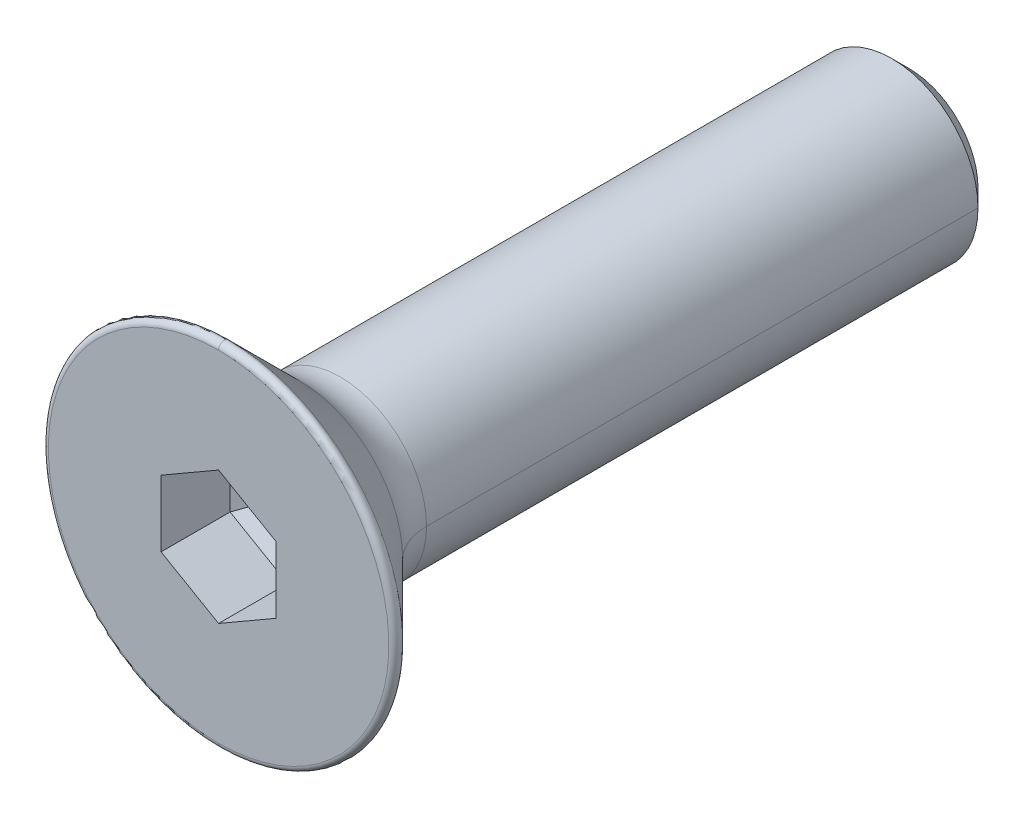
ISO-10303-21;
HEADER;
FILE_DESCRIPTION(('STEP AP214'),'2;1');
FILE_NAME('part.step','',(''),(''),'','','');
FILE_SCHEMA(('AUTOMOTIVE_DESIGN { 1 0 10303 214 1 1 1 1 }'));
ENDSEC;
DATA;
#1=APPLICATION_CONTEXT('core data for automotive mechanical design processes');
#2=APPLICATION_PROTOCOL_DEFINITION('international standard','automotive_design',2000,#1);
#3=PRODUCT_CONTEXT('',#1,'mechanical');
#4=PRODUCT('Part','Part','',(#3));
#5=PRODUCT_RELATED_PRODUCT_CATEGORY('part','',(#4));
#6=PRODUCT_DEFINITION_FORMATION('','',#4);
#7=PRODUCT_DEFINITION_CONTEXT('part definition',#1,'design');
#8=PRODUCT_DEFINITION('design','',#6,#7);
#9=PRODUCT_DEFINITION_SHAPE('','',#8);
#10=(LENGTH_UNIT() NAMED_UNIT(*) SI_UNIT(.MILLI.,.METRE.));
#11=(NAMED_UNIT(*) PLANE_ANGLE_UNIT() SI_UNIT($,.RADIAN.));
#12=(NAMED_UNIT(*) SI_UNIT($,.STERADIAN.) SOLID_ANGLE_UNIT());
#13=UNCERTAINTY_MEASURE_WITH_UNIT(LENGTH_MEASURE(1.E-05),#10,'distance_accuracy_value','');
#14=(GEOMETRIC_REPRESENTATION_CONTEXT(3) GLOBAL_UNCERTAINTY_ASSIGNED_CONTEXT((#13)) GLOBAL_UNIT_ASSIGNED_CONTEXT((#10,
#11,#12)) REPRESENTATION_CONTEXT('',''));
#15=CARTESIAN_POINT('',(0.,0.,0.));
#16=DIRECTION('',(0.,0.,1.));
#17=DIRECTION('',(1.,0.,0.));
#18=AXIS2_PLACEMENT_3D('',#15,#16,#17);
#19=CARTESIAN_POINT('',(0.,0.,0.));
#20=DIRECTION('',(0.,0.,1.));
#21=DIRECTION('',(1.,0.,0.));
#22=AXIS2_PLACEMENT_3D('',#19,#20,#21);
#23=CYLINDRICAL_SURFACE('',#22,1.5);
#24=DIRECTION('',(1.125877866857E-08,-1.397566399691E-11,1.));
#25=VECTOR('',#24,1.);
#26=CARTESIAN_POINT('',(1.499999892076,1.300586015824E-10,0.3000001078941));
#27=LINE('',#26,#25);
#28=CARTESIAN_POINT('',(1.5,0.,0.3000003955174));
#29=VERTEX_POINT('',#28);
#30=CARTESIAN_POINT('',(1.5,0.,9.885786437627));
#31=VERTEX_POINT('',#30);
#32=EDGE_CURVE('E170',#29,#31,#27,.T.);
#33=ORIENTED_EDGE('',*,*,#32,.F.);
#34=CARTESIAN_POINT('',(0.,0.,0.3000003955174));
#35=DIRECTION('',(0.,0.,-1.));
#36=DIRECTION('',(-1.,0.,0.));
#37=AXIS2_PLACEMENT_3D('',#34,#35,#36);
#38=CIRCLE('',#37,1.5);
#39=CARTESIAN_POINT('',(-1.5,0.,0.3000003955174));
#40=VERTEX_POINT('',#39);
#41=EDGE_CURVE('E265',#40,#29,#38,.T.);
#42=ORIENTED_EDGE('',*,*,#41,.F.);
#43=DIRECTION('',(-1.125877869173E-08,1.383975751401E-11,1.));
#44=VECTOR('',#43,1.);
#45=CARTESIAN_POINT('',(-1.499999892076,-1.300583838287E-10,0.3000001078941));
#46=LINE('',#45,#44);
#47=CARTESIAN_POINT('',(-1.5,0.,9.885786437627));
#48=VERTEX_POINT('',#47);
#49=EDGE_CURVE('E163',#40,#48,#46,.T.);
#50=ORIENTED_EDGE('',*,*,#49,.T.);
#51=CARTESIAN_POINT('',(0.,0.,9.885786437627));
#52=DIRECTION('',(0.,0.,-1.));
#53=DIRECTION('',(-1.,0.,0.));
#54=AXIS2_PLACEMENT_3D('',#51,#52,#53);
#55=CIRCLE('',#54,1.5);
#56=EDGE_CURVE('E197',#48,#31,#55,.T.);
#57=ORIENTED_EDGE('',*,*,#56,.T.);
#58=EDGE_LOOP('',(#33,#42,#50,#57));
#59=FACE_BOUND('',#58,.T.);
#60=ADVANCED_FACE('F16',(#59),#23,.T.);
#61=CARTESIAN_POINT('',(0.,0.,9.885786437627));
#62=DIRECTION('',(0.,0.,1.));
#63=DIRECTION('',(-0.0139722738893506,-0.999902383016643,0.));
#64=AXIS2_PLACEMENT_3D('',#61,#62,#63);
#65=TOROIDAL_SURFACE('',#64,2.5,1.);
#66=CARTESIAN_POINT('',(2.5,-2.01547827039E-10,9.885786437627));
#67=DIRECTION('',(8.061912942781E-11,1.,0.));
#68=DIRECTION('',(-1.,8.061912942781E-11,0.));
#69=AXIS2_PLACEMENT_3D('',#66,#67,#68);
#70=CIRCLE('',#69,1.);
#71=CARTESIAN_POINT('',(1.792893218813,0.,10.59289321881));
#72=VERTEX_POINT('',#71);
#73=EDGE_CURVE('E20',#31,#72,#70,.T.);
#74=ORIENTED_EDGE('',*,*,#73,.T.);
#75=CARTESIAN_POINT('',(0.,0.,10.59289321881));
#76=DIRECTION('',(0.,0.,1.));
#77=DIRECTION('',(0.,-1.,0.));
#78=AXIS2_PLACEMENT_3D('',#75,#76,#77);
#79=CIRCLE('',#78,1.792893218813);
#80=CARTESIAN_POINT('',(0.,-1.792893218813,10.59289321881));
#81=VERTEX_POINT('',#80);
#82=EDGE_CURVE('E10',#81,#72,#79,.T.);
#83=ORIENTED_EDGE('',*,*,#82,.F.);
#84=CARTESIAN_POINT('',(-1.556611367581E-10,-2.5,9.885786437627));
#85=DIRECTION('',(1.,-6.226445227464E-11,0.));
#86=DIRECTION('',(6.226445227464E-11,1.,0.));
#87=AXIS2_PLACEMENT_3D('',#84,#85,#86);
#88=CIRCLE('',#87,1.);
#89=CARTESIAN_POINT('',(0.,-1.5,9.885786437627));
#90=VERTEX_POINT('',#89);
#91=EDGE_CURVE('E278',#90,#81,#88,.T.);
#92=ORIENTED_EDGE('',*,*,#91,.F.);
#93=CARTESIAN_POINT('',(0.,0.,9.885786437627));
#94=DIRECTION('',(0.,0.,1.));
#95=DIRECTION('',(0.,-1.,0.));
#96=AXIS2_PLACEMENT_3D('',#93,#94,#95);
#97=CIRCLE('',#96,1.5);
#98=EDGE_CURVE('E194',#90,#31,#97,.T.);
#99=ORIENTED_EDGE('',*,*,#98,.T.);
#100=EDGE_LOOP('',(#74,#83,#92,#99));
#101=FACE_BOUND('',#100,.T.);
#102=ADVANCED_FACE('F192',(#101),#65,.F.);
#103=CARTESIAN_POINT('',(0.,0.,11.21109127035));
#104=DIRECTION('',(0.,0.,1.));
#105=DIRECTION('',(0.,1.,0.));
#106=AXIS2_PLACEMENT_3D('',#103,#104,#105);
#107=CONICAL_SURFACE('',#106,2.411091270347,0.7853981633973);
#108=DIRECTION('',(-1.68789271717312E-12,-0.707106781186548,0.707106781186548));
#109=VECTOR('',#108,1.);
#110=CARTESIAN_POINT('',(-9.017178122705E-13,-1.792893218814,10.59289321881));
#111=LINE('',#110,#109);
#112=CARTESIAN_POINT('',(0.,-3.029289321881,11.82928932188));
#113=VERTEX_POINT('',#112);
#114=EDGE_CURVE('E187',#81,#113,#111,.T.);
#115=ORIENTED_EDGE('',*,*,#114,.F.);
#116=ORIENTED_EDGE('',*,*,#82,.T.);
#117=CARTESIAN_POINT('',(0.,0.,10.59289321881));
#118=DIRECTION('',(0.,0.,1.));
#119=DIRECTION('',(1.,0.,0.));
#120=AXIS2_PLACEMENT_3D('',#117,#118,#119);
#121=CIRCLE('',#120,1.792893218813);
#122=CARTESIAN_POINT('',(0.,1.792893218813,10.59289321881));
#123=VERTEX_POINT('',#122);
#124=EDGE_CURVE('E185',#72,#123,#121,.T.);
#125=ORIENTED_EDGE('',*,*,#124,.T.);
#126=DIRECTION('',(1.85910408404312E-12,0.707106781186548,0.707106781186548));
#127=VECTOR('',#126,1.);
#128=CARTESIAN_POINT('',(6.008498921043E-13,1.792893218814,10.59289321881));
#129=LINE('',#128,#127);
#130=CARTESIAN_POINT('',(0.,3.029289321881,11.82928932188));
#131=VERTEX_POINT('',#130);
#132=EDGE_CURVE('E249',#123,#131,#129,.T.);
#133=ORIENTED_EDGE('',*,*,#132,.T.);
#134=CARTESIAN_POINT('',(0.,0.,11.82928932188));
#135=DIRECTION('',(0.,0.,1.));
#136=DIRECTION('',(0.,-1.,0.));
#137=AXIS2_PLACEMENT_3D('',#134,#135,#136);
#138=CIRCLE('',#137,3.029289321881);
#139=EDGE_CURVE('E27',#113,#131,#138,.T.);
#140=ORIENTED_EDGE('',*,*,#139,.F.);
#141=EDGE_LOOP('',(#115,#116,#125,#133,#140));
#142=FACE_BOUND('',#141,.T.);
#143=ADVANCED_FACE('F182',(#142),#107,.T.);
#144=CARTESIAN_POINT('',(0.,0.,11.9));
#145=DIRECTION('',(0.,0.,-1.));
#146=DIRECTION('',(-0.0131526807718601,-0.999913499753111,0.));
#147=AXIS2_PLACEMENT_3D('',#144,#145,#146);
#148=TOROIDAL_SURFACE('',#147,2.958578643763,0.1);
#149=CARTESIAN_POINT('',(0.,-2.958578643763,11.9));
#150=DIRECTION('',(1.,0.,0.));
#151=DIRECTION('',(0.,0.,1.));
#152=AXIS2_PLACEMENT_3D('',#149,#150,#151);
#153=CIRCLE('',#152,0.1);
#154=CARTESIAN_POINT('',(0.,-2.958578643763,12.));
#155=VERTEX_POINT('',#154);
#156=EDGE_CURVE('E337',#155,#113,#153,.T.);
#157=ORIENTED_EDGE('',*,*,#156,.T.);
#158=ORIENTED_EDGE('',*,*,#139,.T.);
#159=CARTESIAN_POINT('',(0.,2.958578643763,11.9));
#160=DIRECTION('',(-1.,0.,0.));
#161=DIRECTION('',(0.,0.,1.));
#162=AXIS2_PLACEMENT_3D('',#159,#160,#161);
#163=CIRCLE('',#162,0.1);
#164=CARTESIAN_POINT('',(0.,2.958578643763,12.));
#165=VERTEX_POINT('',#164);
#166=EDGE_CURVE('E291',#165,#131,#163,.T.);
#167=ORIENTED_EDGE('',*,*,#166,.F.);
#168=CARTESIAN_POINT('',(0.,0.,12.));
#169=DIRECTION('',(0.,0.,1.));
#170=DIRECTION('',(0.,-1.,0.));
#171=AXIS2_PLACEMENT_3D('',#168,#169,#170);
#172=CIRCLE('',#171,2.958578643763);
#173=EDGE_CURVE('E227',#155,#165,#172,.T.);
#174=ORIENTED_EDGE('',*,*,#173,.F.);
#175=EDGE_LOOP('',(#157,#158,#167,#174));
#176=FACE_BOUND('',#175,.T.);
#177=ADVANCED_FACE('F449',(#176),#148,.T.);
#178=CARTESIAN_POINT('',(0.,0.,10.2));
#179=DIRECTION('',(0.,0.,1.));
#180=DIRECTION('',(1.,0.,0.));
#181=AXIS2_PLACEMENT_3D('',#178,#179,#180);
#182=PLANE('',#181);
#183=DIRECTION('',(0.,1.,0.));
#184=VECTOR('',#183,1.);
#185=CARTESIAN_POINT('',(0.04330127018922,-0.025,10.2));
#186=LINE('',#185,#184);
#187=CARTESIAN_POINT('',(0.04330127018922,-0.025,10.2));
#188=VERTEX_POINT('',#187);
#189=CARTESIAN_POINT('',(0.04330127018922,0.025,10.2));
#190=VERTEX_POINT('',#189);
#191=EDGE_CURVE('E41',#188,#190,#186,.T.);
#192=ORIENTED_EDGE('',*,*,#191,.T.);
#193=DIRECTION('',(-0.866025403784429,0.500000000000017,0.));
#194=VECTOR('',#193,1.);
#195=CARTESIAN_POINT('',(0.04330127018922,0.025,10.2));
#196=LINE('',#195,#194);
#197=CARTESIAN_POINT('',(0.,0.05,10.2));
#198=VERTEX_POINT('',#197);
#199=EDGE_CURVE('E281',#190,#198,#196,.T.);
#200=ORIENTED_EDGE('',*,*,#199,.T.);
#201=DIRECTION('',(-0.866025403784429,-0.500000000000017,0.));
#202=VECTOR('',#201,1.);
#203=CARTESIAN_POINT('',(0.,0.05,10.2));
#204=LINE('',#203,#202);
#205=CARTESIAN_POINT('',(-0.04330127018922,0.025,10.2));
#206=VERTEX_POINT('',#205);
#207=EDGE_CURVE('E294',#198,#206,#204,.T.);
#208=ORIENTED_EDGE('',*,*,#207,.T.);
#209=DIRECTION('',(0.,-1.,0.));
#210=VECTOR('',#209,1.);
#211=CARTESIAN_POINT('',(-0.04330127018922,0.025,10.2));
#212=LINE('',#211,#210);
#213=CARTESIAN_POINT('',(-0.04330127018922,-0.025,10.2));
#214=VERTEX_POINT('',#213);
#215=EDGE_CURVE('E270',#206,#214,#212,.T.);
#216=ORIENTED_EDGE('',*,*,#215,.T.);
#217=DIRECTION('',(0.866025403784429,-0.500000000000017,0.));
#218=VECTOR('',#217,1.);
#219=CARTESIAN_POINT('',(-0.04330127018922,-0.025,10.2));
#220=LINE('',#219,#218);
#221=CARTESIAN_POINT('',(0.,-0.05,10.2));
#222=VERTEX_POINT('',#221);
#223=EDGE_CURVE('E219',#214,#222,#220,.T.);
#224=ORIENTED_EDGE('',*,*,#223,.T.);
#225=DIRECTION('',(0.866025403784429,0.500000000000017,0.));
#226=VECTOR('',#225,1.);
#227=CARTESIAN_POINT('',(0.,-0.05,10.2));
#228=LINE('',#227,#226);
#229=EDGE_CURVE('E309',#222,#188,#228,.T.);
#230=ORIENTED_EDGE('',*,*,#229,.T.);
#231=EDGE_LOOP('',(#192,#200,#208,#216,#224,#230));
#232=FACE_BOUND('',#231,.T.);
#233=ADVANCED_FACE('F406',(#232),#182,.T.);
#234=CARTESIAN_POINT('',(1.,-0.5773502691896,12.));
#235=DIRECTION('',(1.,0.,0.));
#236=DIRECTION('',(0.,1.,0.));
#237=AXIS2_PLACEMENT_3D('',#234,#235,#236);
#238=PLANE('',#237);
#239=DIRECTION('',(0.,0.,-1.));
#240=VECTOR('',#239,1.);
#241=CARTESIAN_POINT('',(1.,-0.5773502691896,12.));
#242=LINE('',#241,#240);
#243=CARTESIAN_POINT('',(1.,-0.5773502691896,12.));
#244=VERTEX_POINT('',#243);
#245=CARTESIAN_POINT('',(1.,-0.5773502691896,10.8));
#246=VERTEX_POINT('',#245);
#247=EDGE_CURVE('E239',#244,#246,#242,.T.);
#248=ORIENTED_EDGE('',*,*,#247,.F.);
#249=DIRECTION('',(0.,1.,0.));
#250=VECTOR('',#249,1.);
#251=CARTESIAN_POINT('',(1.,-0.5773502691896,12.));
#252=LINE('',#251,#250);
#253=CARTESIAN_POINT('',(1.,0.5773502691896,12.));
#254=VERTEX_POINT('',#253);
#255=EDGE_CURVE('E331',#244,#254,#252,.T.);
#256=ORIENTED_EDGE('',*,*,#255,.T.);
#257=DIRECTION('',(0.,0.,-1.));
#258=VECTOR('',#257,1.);
#259=CARTESIAN_POINT('',(1.,0.5773502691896,12.));
#260=LINE('',#259,#258);
#261=CARTESIAN_POINT('',(1.,0.5773502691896,10.8));
#262=VERTEX_POINT('',#261);
#263=EDGE_CURVE('E240',#254,#262,#260,.T.);
#264=ORIENTED_EDGE('',*,*,#263,.T.);
#265=DIRECTION('',(0.,1.,0.));
#266=VECTOR('',#265,1.);
#267=CARTESIAN_POINT('',(1.,-0.5773502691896,10.8));
#268=LINE('',#267,#266);
#269=EDGE_CURVE('E225',#246,#262,#268,.T.);
#270=ORIENTED_EDGE('',*,*,#269,.F.);
#271=EDGE_LOOP('',(#248,#256,#264,#270));
#272=FACE_BOUND('',#271,.T.);
#273=ADVANCED_FACE('F402',(#272),#238,.F.);
#274=CARTESIAN_POINT('',(0.5216506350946,0.,10.5));
#275=DIRECTION('',(0.531312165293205,0.,-0.847176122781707));
#276=DIRECTION('',(0.,-1.,0.));
#277=AXIS2_PLACEMENT_3D('',#274,#275,#276);
#278=PLANE('',#277);
#279=DIRECTION('',(0.761021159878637,0.439375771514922,0.477279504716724));
#280=VECTOR('',#279,1.);
#281=CARTESIAN_POINT('',(0.04330127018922,0.025,10.2));
#282=LINE('',#281,#280);
#283=EDGE_CURVE('E226',#190,#262,#282,.T.);
#284=ORIENTED_EDGE('',*,*,#283,.F.);
#285=ORIENTED_EDGE('',*,*,#191,.F.);
#286=DIRECTION('',(0.761021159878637,-0.439375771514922,0.477279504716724));
#287=VECTOR('',#286,1.);
#288=CARTESIAN_POINT('',(0.04330127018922,-0.025,10.2));
#289=LINE('',#288,#287);
#290=EDGE_CURVE('E238',#188,#246,#289,.T.);
#291=ORIENTED_EDGE('',*,*,#290,.T.);
#292=ORIENTED_EDGE('',*,*,#269,.T.);
#293=EDGE_LOOP('',(#284,#285,#291,#292));
#294=FACE_BOUND('',#293,.T.);
#295=ADVANCED_FACE('F404',(#294),#278,.F.);
#296=CARTESIAN_POINT('',(0.2608253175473,0.4517627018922,10.5));
#297=DIRECTION('',(0.265656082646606,0.46012983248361,-0.847176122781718));
#298=DIRECTION('',(-0.954186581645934,0.,-0.299212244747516));
#299=AXIS2_PLACEMENT_3D('',#296,#297,#298);
#300=PLANE('',#299);
#301=DIRECTION('',(0.,0.878751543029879,0.477279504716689));
#302=VECTOR('',#301,1.);
#303=CARTESIAN_POINT('',(0.,0.05,10.2));
#304=LINE('',#303,#302);
#305=CARTESIAN_POINT('',(0.,1.154700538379,10.8));
#306=VERTEX_POINT('',#305);
#307=EDGE_CURVE('E287',#198,#306,#304,.T.);
#308=ORIENTED_EDGE('',*,*,#307,.F.);
#309=ORIENTED_EDGE('',*,*,#199,.F.);
#310=ORIENTED_EDGE('',*,*,#283,.T.);
#311=DIRECTION('',(-0.866025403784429,0.500000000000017,0.));
#312=VECTOR('',#311,1.);
#313=CARTESIAN_POINT('',(1.,0.5773502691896,10.8));
#314=LINE('',#313,#312);
#315=EDGE_CURVE('E244',#262,#306,#314,.T.);
#316=ORIENTED_EDGE('',*,*,#315,.T.);
#317=EDGE_LOOP('',(#308,#309,#310,#316));
#318=FACE_BOUND('',#317,.T.);
#319=ADVANCED_FACE('F459',(#318),#300,.F.);
#320=CARTESIAN_POINT('',(1.,0.5773502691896,12.));
#321=DIRECTION('',(0.500000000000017,0.866025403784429,0.));
#322=DIRECTION('',(0.,0.,-1.));
#323=AXIS2_PLACEMENT_3D('',#320,#321,#322);
#324=PLANE('',#323);
#325=ORIENTED_EDGE('',*,*,#263,.F.);
#326=DIRECTION('',(-0.866025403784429,0.500000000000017,0.));
#327=VECTOR('',#326,1.);
#328=CARTESIAN_POINT('',(1.,0.5773502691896,12.));
#329=LINE('',#328,#327);
#330=CARTESIAN_POINT('',(0.,1.154700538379,12.));
#331=VERTEX_POINT('',#330);
#332=EDGE_CURVE('E315',#254,#331,#329,.T.);
#333=ORIENTED_EDGE('',*,*,#332,.T.);
#334=DIRECTION('',(0.,0.,-1.));
#335=VECTOR('',#334,1.);
#336=CARTESIAN_POINT('',(0.,1.154700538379,12.));
#337=LINE('',#336,#335);
#338=EDGE_CURVE('E245',#331,#306,#337,.T.);
#339=ORIENTED_EDGE('',*,*,#338,.T.);
#340=ORIENTED_EDGE('',*,*,#315,.F.);
#341=EDGE_LOOP('',(#325,#333,#339,#340));
#342=FACE_BOUND('',#341,.T.);
#343=ADVANCED_FACE('F463',(#342),#324,.F.);
#344=CARTESIAN_POINT('',(0.,1.154700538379,12.));
#345=DIRECTION('',(-0.500000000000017,0.866025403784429,0.));
#346=DIRECTION('',(0.,0.,1.));
#347=AXIS2_PLACEMENT_3D('',#344,#345,#346);
#348=PLANE('',#347);
#349=ORIENTED_EDGE('',*,*,#338,.F.);
#350=DIRECTION('',(-0.866025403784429,-0.500000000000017,0.));
#351=VECTOR('',#350,1.);
#352=CARTESIAN_POINT('',(0.,1.154700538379,12.));
#353=LINE('',#352,#351);
#354=CARTESIAN_POINT('',(-1.,0.5773502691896,12.));
#355=VERTEX_POINT('',#354);
#356=EDGE_CURVE('E264',#331,#355,#353,.T.);
#357=ORIENTED_EDGE('',*,*,#356,.T.);
#358=DIRECTION('',(0.,0.,-1.));
#359=VECTOR('',#358,1.);
#360=CARTESIAN_POINT('',(-1.,0.5773502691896,12.));
#361=LINE('',#360,#359);
#362=CARTESIAN_POINT('',(-1.,0.5773502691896,10.8));
#363=VERTEX_POINT('',#362);
#364=EDGE_CURVE('E259',#355,#363,#361,.T.);
#365=ORIENTED_EDGE('',*,*,#364,.T.);
#366=DIRECTION('',(-0.866025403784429,-0.500000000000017,0.));
#367=VECTOR('',#366,1.);
#368=CARTESIAN_POINT('',(0.,1.154700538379,10.8));
#369=LINE('',#368,#367);
#370=EDGE_CURVE('E284',#306,#363,#369,.T.);
#371=ORIENTED_EDGE('',*,*,#370,.F.);
#372=EDGE_LOOP('',(#349,#357,#365,#371));
#373=FACE_BOUND('',#372,.T.);
#374=ADVANCED_FACE('F469',(#373),#348,.F.);
#375=CARTESIAN_POINT('',(-0.2608253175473,0.4517627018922,10.5));
#376=DIRECTION('',(-0.265656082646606,0.46012983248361,-0.847176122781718));
#377=DIRECTION('',(-0.954186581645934,0.,0.299212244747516));
#378=AXIS2_PLACEMENT_3D('',#375,#376,#377);
#379=PLANE('',#378);
#380=DIRECTION('',(-0.761021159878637,0.439375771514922,0.477279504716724));
#381=VECTOR('',#380,1.);
#382=CARTESIAN_POINT('',(-0.04330127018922,0.025,10.2));
#383=LINE('',#382,#381);
#384=EDGE_CURVE('E272',#206,#363,#383,.T.);
#385=ORIENTED_EDGE('',*,*,#384,.F.);
#386=ORIENTED_EDGE('',*,*,#207,.F.);
#387=ORIENTED_EDGE('',*,*,#307,.T.);
#388=ORIENTED_EDGE('',*,*,#370,.T.);
#389=EDGE_LOOP('',(#385,#386,#387,#388));
#390=FACE_BOUND('',#389,.T.);
#391=ADVANCED_FACE('F478',(#390),#379,.F.);
#392=CARTESIAN_POINT('',(-0.5216506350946,0.,10.5));
#393=DIRECTION('',(-0.531312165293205,0.,-0.847176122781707));
#394=DIRECTION('',(-0.847176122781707,0.,0.531312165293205));
#395=AXIS2_PLACEMENT_3D('',#392,#393,#394);
#396=PLANE('',#395);
#397=DIRECTION('',(-0.761021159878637,-0.439375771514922,0.477279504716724));
#398=VECTOR('',#397,1.);
#399=CARTESIAN_POINT('',(-0.04330127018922,-0.025,10.2));
#400=LINE('',#399,#398);
#401=CARTESIAN_POINT('',(-1.,-0.5773502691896,10.8));
#402=VERTEX_POINT('',#401);
#403=EDGE_CURVE('E215',#214,#402,#400,.T.);
#404=ORIENTED_EDGE('',*,*,#403,.F.);
#405=ORIENTED_EDGE('',*,*,#215,.F.);
#406=ORIENTED_EDGE('',*,*,#384,.T.);
#407=DIRECTION('',(0.,-1.,0.));
#408=VECTOR('',#407,1.);
#409=CARTESIAN_POINT('',(-1.,0.5773502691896,10.8));
#410=LINE('',#409,#408);
#411=EDGE_CURVE('E273',#363,#402,#410,.T.);
#412=ORIENTED_EDGE('',*,*,#411,.T.);
#413=EDGE_LOOP('',(#404,#405,#406,#412));
#414=FACE_BOUND('',#413,.T.);
#415=ADVANCED_FACE('F456',(#414),#396,.F.);
#416=CARTESIAN_POINT('',(-1.,0.5773502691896,12.));
#417=DIRECTION('',(-1.,0.,0.));
#418=DIRECTION('',(0.,0.,1.));
#419=AXIS2_PLACEMENT_3D('',#416,#417,#418);
#420=PLANE('',#419);
#421=ORIENTED_EDGE('',*,*,#364,.F.);
#422=DIRECTION('',(0.,-1.,0.));
#423=VECTOR('',#422,1.);
#424=CARTESIAN_POINT('',(-1.,0.5773502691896,12.));
#425=LINE('',#424,#423);
#426=CARTESIAN_POINT('',(-1.,-0.5773502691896,12.));
#427=VERTEX_POINT('',#426);
#428=EDGE_CURVE('E260',#355,#427,#425,.T.);
#429=ORIENTED_EDGE('',*,*,#428,.T.);
#430=DIRECTION('',(0.,0.,-1.));
#431=VECTOR('',#430,1.);
#432=CARTESIAN_POINT('',(-1.,-0.5773502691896,12.));
#433=LINE('',#432,#431);
#434=EDGE_CURVE('E255',#427,#402,#433,.T.);
#435=ORIENTED_EDGE('',*,*,#434,.T.);
#436=ORIENTED_EDGE('',*,*,#411,.F.);
#437=EDGE_LOOP('',(#421,#429,#435,#436));
#438=FACE_BOUND('',#437,.T.);
#439=ADVANCED_FACE('F454',(#438),#420,.F.);
#440=CARTESIAN_POINT('',(-1.,-0.5773502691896,12.));
#441=DIRECTION('',(-0.500000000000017,-0.866025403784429,0.));
#442=DIRECTION('',(-0.866025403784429,0.500000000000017,0.));
#443=AXIS2_PLACEMENT_3D('',#440,#441,#442);
#444=PLANE('',#443);
#445=ORIENTED_EDGE('',*,*,#434,.F.);
#446=DIRECTION('',(0.866025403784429,-0.500000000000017,0.));
#447=VECTOR('',#446,1.);
#448=CARTESIAN_POINT('',(-1.,-0.5773502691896,12.));
#449=LINE('',#448,#447);
#450=CARTESIAN_POINT('',(0.,-1.154700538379,12.));
#451=VERTEX_POINT('',#450);
#452=EDGE_CURVE('E230',#427,#451,#449,.T.);
#453=ORIENTED_EDGE('',*,*,#452,.T.);
#454=DIRECTION('',(0.,0.,-1.));
#455=VECTOR('',#454,1.);
#456=CARTESIAN_POINT('',(0.,-1.154700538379,12.));
#457=LINE('',#456,#455);
#458=CARTESIAN_POINT('',(0.,-1.154700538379,10.8));
#459=VERTEX_POINT('',#458);
#460=EDGE_CURVE('E250',#451,#459,#457,.T.);
#461=ORIENTED_EDGE('',*,*,#460,.T.);
#462=DIRECTION('',(0.866025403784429,-0.500000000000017,0.));
#463=VECTOR('',#462,1.);
#464=CARTESIAN_POINT('',(-1.,-0.5773502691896,10.8));
#465=LINE('',#464,#463);
#466=EDGE_CURVE('E218',#402,#459,#465,.T.);
#467=ORIENTED_EDGE('',*,*,#466,.F.);
#468=EDGE_LOOP('',(#445,#453,#461,#467));
#469=FACE_BOUND('',#468,.T.);
#470=ADVANCED_FACE('F391',(#469),#444,.F.);
#471=CARTESIAN_POINT('',(-0.2608253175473,-0.4517627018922,10.5));
#472=DIRECTION('',(-0.265656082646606,-0.46012983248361,-0.847176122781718));
#473=DIRECTION('',(0.,-0.878751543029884,0.477279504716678));
#474=AXIS2_PLACEMENT_3D('',#471,#472,#473);
#475=PLANE('',#474);
#476=DIRECTION('',(0.,-0.878751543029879,0.477279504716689));
#477=VECTOR('',#476,1.);
#478=CARTESIAN_POINT('',(0.,-0.05,10.2));
#479=LINE('',#478,#477);
#480=EDGE_CURVE('E316',#222,#459,#479,.T.);
#481=ORIENTED_EDGE('',*,*,#480,.F.);
#482=ORIENTED_EDGE('',*,*,#223,.F.);
#483=ORIENTED_EDGE('',*,*,#403,.T.);
#484=ORIENTED_EDGE('',*,*,#466,.T.);
#485=EDGE_LOOP('',(#481,#482,#483,#484));
#486=FACE_BOUND('',#485,.T.);
#487=ADVANCED_FACE('F379',(#486),#475,.F.);
#488=CARTESIAN_POINT('',(0.2608253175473,-0.4517627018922,10.5));
#489=DIRECTION('',(0.265656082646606,-0.46012983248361,-0.847176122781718));
#490=DIRECTION('',(0.,-0.878751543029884,0.477279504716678));
#491=AXIS2_PLACEMENT_3D('',#488,#489,#490);
#492=PLANE('',#491);
#493=ORIENTED_EDGE('',*,*,#290,.F.);
#494=ORIENTED_EDGE('',*,*,#229,.F.);
#495=ORIENTED_EDGE('',*,*,#480,.T.);
#496=DIRECTION('',(0.866025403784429,0.500000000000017,0.));
#497=VECTOR('',#496,1.);
#498=CARTESIAN_POINT('',(0.,-1.154700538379,10.8));
#499=LINE('',#498,#497);
#500=EDGE_CURVE('E234',#459,#246,#499,.T.);
#501=ORIENTED_EDGE('',*,*,#500,.T.);
#502=EDGE_LOOP('',(#493,#494,#495,#501));
#503=FACE_BOUND('',#502,.T.);
#504=ADVANCED_FACE('F387',(#503),#492,.F.);
#505=CARTESIAN_POINT('',(0.,-1.154700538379,12.));
#506=DIRECTION('',(0.500000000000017,-0.866025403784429,0.));
#507=DIRECTION('',(0.,0.,-1.));
#508=AXIS2_PLACEMENT_3D('',#505,#506,#507);
#509=PLANE('',#508);
#510=ORIENTED_EDGE('',*,*,#460,.F.);
#511=DIRECTION('',(0.866025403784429,0.500000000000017,0.));
#512=VECTOR('',#511,1.);
#513=CARTESIAN_POINT('',(0.,-1.154700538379,12.));
#514=LINE('',#513,#512);
#515=EDGE_CURVE('E254',#451,#244,#514,.T.);
#516=ORIENTED_EDGE('',*,*,#515,.T.);
#517=ORIENTED_EDGE('',*,*,#247,.T.);
#518=ORIENTED_EDGE('',*,*,#500,.F.);
#519=EDGE_LOOP('',(#510,#516,#517,#518));
#520=FACE_BOUND('',#519,.T.);
#521=ADVANCED_FACE('F389',(#520),#509,.F.);
#522=CARTESIAN_POINT('',(0.,0.,12.));
#523=DIRECTION('',(0.,0.,-1.));
#524=DIRECTION('',(0.,-1.,0.));
#525=AXIS2_PLACEMENT_3D('',#522,#523,#524);
#526=PLANE('',#525);
#527=ORIENTED_EDGE('',*,*,#452,.F.);
#528=ORIENTED_EDGE('',*,*,#428,.F.);
#529=ORIENTED_EDGE('',*,*,#356,.F.);
#530=ORIENTED_EDGE('',*,*,#332,.F.);
#531=ORIENTED_EDGE('',*,*,#255,.F.);
#532=ORIENTED_EDGE('',*,*,#515,.F.);
#533=EDGE_LOOP('',(#527,#528,#529,#530,#531,#532));
#534=FACE_BOUND('',#533,.T.);
#535=CARTESIAN_POINT('',(0.,0.,12.));
#536=DIRECTION('',(0.,0.,1.));
#537=DIRECTION('',(0.,1.,0.));
#538=AXIS2_PLACEMENT_3D('',#535,#536,#537);
#539=CIRCLE('',#538,2.958578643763);
#540=EDGE_CURVE('E231',#165,#155,#539,.T.);
#541=ORIENTED_EDGE('',*,*,#540,.T.);
#542=ORIENTED_EDGE('',*,*,#173,.T.);
#543=EDGE_LOOP('',(#541,#542));
#544=FACE_BOUND('',#543,.T.);
#545=ADVANCED_FACE('F395',(#534,#544),#526,.F.);
#546=CARTESIAN_POINT('',(0.,0.,11.9));
#547=DIRECTION('',(0.,0.,-1.));
#548=DIRECTION('',(0.0131526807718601,0.999913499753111,0.));
#549=AXIS2_PLACEMENT_3D('',#546,#547,#548);
#550=TOROIDAL_SURFACE('',#549,2.958578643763,0.1);
#551=ORIENTED_EDGE('',*,*,#166,.T.);
#552=CARTESIAN_POINT('',(0.,0.,11.82928932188));
#553=DIRECTION('',(0.,0.,1.));
#554=DIRECTION('',(0.,1.,0.));
#555=AXIS2_PLACEMENT_3D('',#552,#553,#554);
#556=CIRCLE('',#555,3.029289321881);
#557=EDGE_CURVE('E248',#131,#113,#556,.T.);
#558=ORIENTED_EDGE('',*,*,#557,.T.);
#559=ORIENTED_EDGE('',*,*,#156,.F.);
#560=ORIENTED_EDGE('',*,*,#540,.F.);
#561=EDGE_LOOP('',(#551,#558,#559,#560));
#562=FACE_BOUND('',#561,.T.);
#563=ADVANCED_FACE('F446',(#562),#550,.T.);
#564=CARTESIAN_POINT('',(0.,0.,11.21109127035));
#565=DIRECTION('',(0.,0.,1.));
#566=DIRECTION('',(0.,1.,0.));
#567=AXIS2_PLACEMENT_3D('',#564,#565,#566);
#568=CONICAL_SURFACE('',#567,2.411091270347,0.7853981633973);
#569=ORIENTED_EDGE('',*,*,#132,.F.);
#570=CARTESIAN_POINT('',(0.,0.,10.59289321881));
#571=DIRECTION('',(0.,0.,1.));
#572=DIRECTION('',(0.,1.,0.));
#573=AXIS2_PLACEMENT_3D('',#570,#571,#572);
#574=CIRCLE('',#573,1.792893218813);
#575=EDGE_CURVE('E201',#123,#81,#574,.T.);
#576=ORIENTED_EDGE('',*,*,#575,.T.);
#577=ORIENTED_EDGE('',*,*,#114,.T.);
#578=ORIENTED_EDGE('',*,*,#557,.F.);
#579=EDGE_LOOP('',(#569,#576,#577,#578));
#580=FACE_BOUND('',#579,.T.);
#581=ADVANCED_FACE('F432',(#580),#568,.T.);
#582=CARTESIAN_POINT('',(0.,0.,9.885786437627));
#583=DIRECTION('',(0.,0.,1.));
#584=DIRECTION('',(0.0139722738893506,0.999902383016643,0.));
#585=AXIS2_PLACEMENT_3D('',#582,#583,#584);
#586=TOROIDAL_SURFACE('',#585,2.5,1.);
#587=ORIENTED_EDGE('',*,*,#124,.F.);
#588=ORIENTED_EDGE('',*,*,#73,.F.);
#589=ORIENTED_EDGE('',*,*,#56,.F.);
#590=CARTESIAN_POINT('',(0.,0.,9.885786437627));
#591=DIRECTION('',(0.,0.,1.));
#592=DIRECTION('',(-1.,0.,0.));
#593=AXIS2_PLACEMENT_3D('',#590,#591,#592);
#594=CIRCLE('',#593,1.5);
#595=EDGE_CURVE('E203',#48,#90,#594,.T.);
#596=ORIENTED_EDGE('',*,*,#595,.T.);
#597=ORIENTED_EDGE('',*,*,#91,.T.);
#598=ORIENTED_EDGE('',*,*,#575,.F.);
#599=EDGE_LOOP('',(#587,#588,#589,#596,#597,#598));
#600=FACE_BOUND('',#599,.T.);
#601=ADVANCED_FACE('F199',(#600),#586,.F.);
#602=CARTESIAN_POINT('',(0.,0.,0.));
#603=DIRECTION('',(0.,0.,1.));
#604=DIRECTION('',(1.,0.,0.));
#605=AXIS2_PLACEMENT_3D('',#602,#603,#604);
#606=CYLINDRICAL_SURFACE('',#605,1.5);
#607=ORIENTED_EDGE('',*,*,#49,.F.);
#608=CARTESIAN_POINT('',(0.,0.,0.3000003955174));
#609=DIRECTION('',(0.,0.,-1.));
#610=DIRECTION('',(1.,0.,0.));
#611=AXIS2_PLACEMENT_3D('',#608,#609,#610);
#612=CIRCLE('',#611,1.5);
#613=EDGE_CURVE('E222',#29,#40,#612,.T.);
#614=ORIENTED_EDGE('',*,*,#613,.F.);
#615=ORIENTED_EDGE('',*,*,#32,.T.);
#616=ORIENTED_EDGE('',*,*,#98,.F.);
#617=ORIENTED_EDGE('',*,*,#595,.F.);
#618=EDGE_LOOP('',(#607,#614,#615,#616,#617));
#619=FACE_BOUND('',#618,.T.);
#620=ADVANCED_FACE('F421',(#619),#606,.T.);
#621=CARTESIAN_POINT('',(0.,0.,0.1500004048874));
#622=DIRECTION('',(0.,0.,1.));
#623=DIRECTION('',(0.,-1.,0.));
#624=AXIS2_PLACEMENT_3D('',#621,#622,#623);
#625=CONICAL_SURFACE('',#624,1.350000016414,0.785398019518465);
#626=DIRECTION('',(0.707106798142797,-2.043672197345E-11,0.707106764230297));
#627=VECTOR('',#626,1.);
#628=CARTESIAN_POINT('',(1.199999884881,1.387291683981E-10,1.150870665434E-07));
#629=LINE('',#628,#627);
#630=CARTESIAN_POINT('',(1.199999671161,0.,1.647018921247E-08));
#631=VERTEX_POINT('',#630);
#632=EDGE_CURVE('E269',#631,#29,#629,.T.);
#633=ORIENTED_EDGE('',*,*,#632,.T.);
#634=ORIENTED_EDGE('',*,*,#613,.T.);
#635=DIRECTION('',(-0.707106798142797,2.043676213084E-11,0.707106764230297));
#636=VECTOR('',#635,1.);
#637=CARTESIAN_POINT('',(-1.199999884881,-1.387289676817E-10,1.150870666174E-07));
#638=LINE('',#637,#636);
#639=CARTESIAN_POINT('',(-1.199999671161,0.,1.647018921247E-08));
#640=VERTEX_POINT('',#639);
#641=EDGE_CURVE('E153',#640,#40,#638,.T.);
#642=ORIENTED_EDGE('',*,*,#641,.F.);
#643=CARTESIAN_POINT('',(0.,0.,1.647018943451E-08));
#644=DIRECTION('',(0.,0.,-1.));
#645=DIRECTION('',(1.,0.,0.));
#646=AXIS2_PLACEMENT_3D('',#643,#644,#645);
#647=CIRCLE('',#646,1.199999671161);
#648=EDGE_CURVE('E213',#631,#640,#647,.T.);
#649=ORIENTED_EDGE('',*,*,#648,.F.);
#650=EDGE_LOOP('',(#633,#634,#642,#649));
#651=FACE_BOUND('',#650,.T.);
#652=ADVANCED_FACE('F423',(#651),#625,.T.);
#653=CARTESIAN_POINT('',(0.,0.,0.1500004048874));
#654=DIRECTION('',(0.,0.,1.));
#655=DIRECTION('',(0.,-1.,0.));
#656=AXIS2_PLACEMENT_3D('',#653,#654,#655);
#657=CONICAL_SURFACE('',#656,1.350000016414,0.785398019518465);
#658=ORIENTED_EDGE('',*,*,#641,.T.);
#659=ORIENTED_EDGE('',*,*,#41,.T.);
#660=ORIENTED_EDGE('',*,*,#632,.F.);
#661=CARTESIAN_POINT('',(0.,0.,1.647018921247E-08));
#662=DIRECTION('',(0.,0.,-1.));
#663=DIRECTION('',(-1.,0.,0.));
#664=AXIS2_PLACEMENT_3D('',#661,#662,#663);
#665=CIRCLE('',#664,1.199999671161);
#666=EDGE_CURVE('E296',#640,#631,#665,.T.);
#667=ORIENTED_EDGE('',*,*,#666,.F.);
#668=EDGE_LOOP('',(#658,#659,#660,#667));
#669=FACE_BOUND('',#668,.T.);
#670=ADVANCED_FACE('F430',(#669),#657,.T.);
#671=CARTESIAN_POINT('',(0.,0.,0.));
#672=DIRECTION('',(0.,0.,1.));
#673=DIRECTION('',(1.,0.,0.));
#674=AXIS2_PLACEMENT_3D('',#671,#672,#673);
#675=PLANE('',#674);
#676=ORIENTED_EDGE('',*,*,#648,.T.);
#677=ORIENTED_EDGE('',*,*,#666,.T.);
#678=EDGE_LOOP('',(#676,#677));
#679=FACE_BOUND('',#678,.T.);
#680=ADVANCED_FACE('F18',(#679),#675,.F.);
#681=CLOSED_SHELL('',(#60,#102,#143,#177,#233,#273,#295,#319,#343,#374,#391,#415,#439,#470,#487,
#504,#521,#545,#563,#581,#601,#620,#652,#670,#680));
#682=MANIFOLD_SOLID_BREP('B1',#681);
#683=ADVANCED_BREP_SHAPE_REPRESENTATION('',(#18,#682),#14);
#684=SHAPE_DEFINITION_REPRESENTATION(#9,#683);
ENDSEC;
END-ISO-10303-21;
